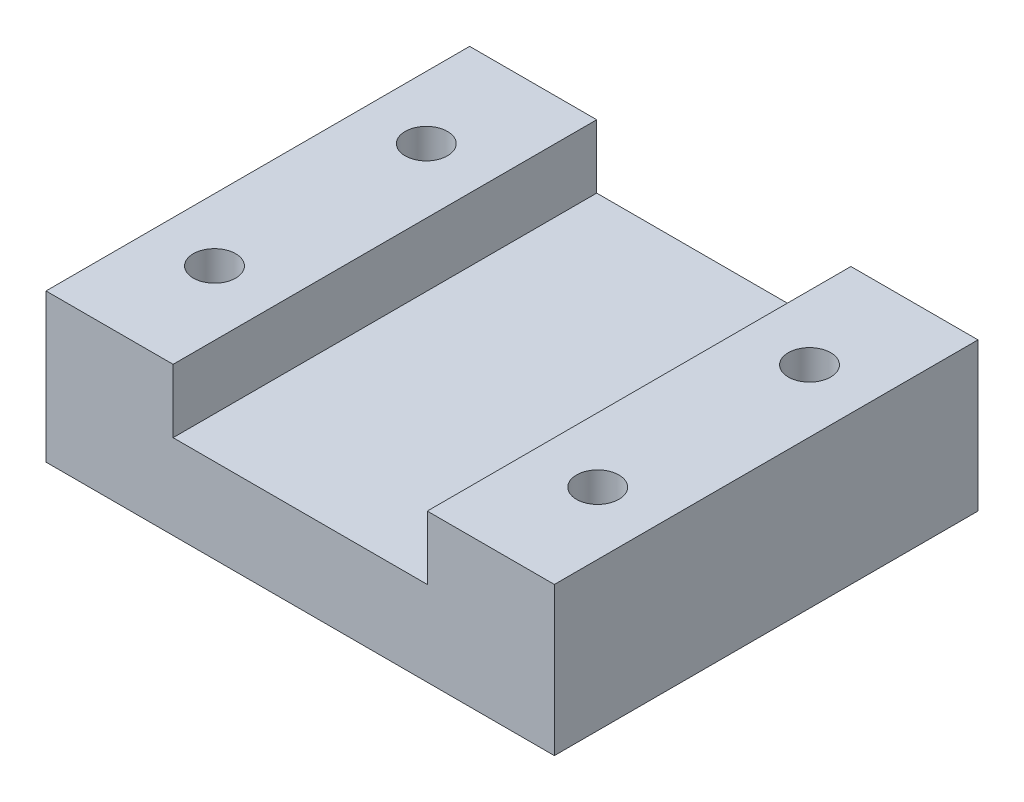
ISO-10303-21;
HEADER;
FILE_DESCRIPTION(('STEP AP214'),'2;1');
FILE_NAME('part.step','',(''),(''),'','','');
FILE_SCHEMA(('AUTOMOTIVE_DESIGN { 1 0 10303 214 1 1 1 1 }'));
ENDSEC;
DATA;
#1=APPLICATION_CONTEXT('core data for automotive mechanical design processes');
#2=APPLICATION_PROTOCOL_DEFINITION('international standard','automotive_design',2000,#1);
#3=PRODUCT_CONTEXT('',#1,'mechanical');
#4=PRODUCT('Part','Part','',(#3));
#5=PRODUCT_RELATED_PRODUCT_CATEGORY('part','',(#4));
#6=PRODUCT_DEFINITION_FORMATION('','',#4);
#7=PRODUCT_DEFINITION_CONTEXT('part definition',#1,'design');
#8=PRODUCT_DEFINITION('design','',#6,#7);
#9=PRODUCT_DEFINITION_SHAPE('','',#8);
#10=(LENGTH_UNIT() NAMED_UNIT(*) SI_UNIT(.MILLI.,.METRE.));
#11=(NAMED_UNIT(*) PLANE_ANGLE_UNIT() SI_UNIT($,.RADIAN.));
#12=(NAMED_UNIT(*) SI_UNIT($,.STERADIAN.) SOLID_ANGLE_UNIT());
#13=UNCERTAINTY_MEASURE_WITH_UNIT(LENGTH_MEASURE(1.E-05),#10,'distance_accuracy_value','');
#14=(GEOMETRIC_REPRESENTATION_CONTEXT(3) GLOBAL_UNCERTAINTY_ASSIGNED_CONTEXT((#13)) GLOBAL_UNIT_ASSIGNED_CONTEXT((#10,
#11,#12)) REPRESENTATION_CONTEXT('',''));
#15=CARTESIAN_POINT('',(0.,0.,0.));
#16=DIRECTION('',(0.,0.,1.));
#17=DIRECTION('',(1.,0.,0.));
#18=AXIS2_PLACEMENT_3D('',#15,#16,#17);
#19=CARTESIAN_POINT('',(-76.2,0.,63.5));
#20=DIRECTION('',(0.,1.,0.));
#21=DIRECTION('',(-1.,0.,0.));
#22=AXIS2_PLACEMENT_3D('',#19,#20,#21);
#23=PLANE('',#22);
#24=CARTESIAN_POINT('',(57.4394586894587,0.,31.75));
#25=DIRECTION('',(0.,-1.,0.));
#26=DIRECTION('',(1.,0.,0.));
#27=AXIS2_PLACEMENT_3D('',#24,#25,#26);
#28=CIRCLE('',#27,6.35);
#29=CARTESIAN_POINT('',(51.0894586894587,0.,31.75));
#30=VERTEX_POINT('',#29);
#31=EDGE_CURVE('E373',#30,#30,#28,.T.);
#32=ORIENTED_EDGE('',*,*,#31,.F.);
#33=EDGE_LOOP('',(#32));
#34=FACE_BOUND('',#33,.T.);
#35=CARTESIAN_POINT('',(-57.4394586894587,0.,-31.75));
#36=DIRECTION('',(0.,1.,0.));
#37=DIRECTION('',(-1.,0.,0.));
#38=AXIS2_PLACEMENT_3D('',#35,#36,#37);
#39=CIRCLE('',#38,6.35);
#40=CARTESIAN_POINT('',(-63.7894586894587,0.,-31.75));
#41=VERTEX_POINT('',#40);
#42=EDGE_CURVE('E379',#41,#41,#39,.T.);
#43=ORIENTED_EDGE('',*,*,#42,.T.);
#44=EDGE_LOOP('',(#43));
#45=FACE_BOUND('',#44,.T.);
#46=CARTESIAN_POINT('',(-57.4394586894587,0.,31.75));
#47=DIRECTION('',(0.,1.,0.));
#48=DIRECTION('',(-1.,0.,0.));
#49=AXIS2_PLACEMENT_3D('',#46,#47,#48);
#50=CIRCLE('',#49,6.35);
#51=CARTESIAN_POINT('',(-63.7894586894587,0.,31.75));
#52=VERTEX_POINT('',#51);
#53=EDGE_CURVE('E125',#52,#52,#50,.T.);
#54=ORIENTED_EDGE('',*,*,#53,.T.);
#55=EDGE_LOOP('',(#54));
#56=FACE_BOUND('',#55,.T.);
#57=DIRECTION('',(1.,0.,0.));
#58=VECTOR('',#57,1.);
#59=CARTESIAN_POINT('',(-76.2,0.,-63.5));
#60=LINE('',#59,#58);
#61=CARTESIAN_POINT('',(-76.2,0.,-63.5));
#62=VERTEX_POINT('',#61);
#63=CARTESIAN_POINT('',(76.2,0.,-63.5));
#64=VERTEX_POINT('',#63);
#65=EDGE_CURVE('E107',#62,#64,#60,.T.);
#66=ORIENTED_EDGE('',*,*,#65,.T.);
#67=DIRECTION('',(0.,0.,-1.));
#68=VECTOR('',#67,1.);
#69=CARTESIAN_POINT('',(76.2,0.,63.5));
#70=LINE('',#69,#68);
#71=CARTESIAN_POINT('',(76.2,0.,63.5));
#72=VERTEX_POINT('',#71);
#73=EDGE_CURVE('E50',#72,#64,#70,.T.);
#74=ORIENTED_EDGE('',*,*,#73,.F.);
#75=DIRECTION('',(1.,0.,0.));
#76=VECTOR('',#75,1.);
#77=CARTESIAN_POINT('',(-76.2,0.,63.5));
#78=LINE('',#77,#76);
#79=CARTESIAN_POINT('',(-76.2,0.,63.5));
#80=VERTEX_POINT('',#79);
#81=EDGE_CURVE('E120',#80,#72,#78,.T.);
#82=ORIENTED_EDGE('',*,*,#81,.F.);
#83=DIRECTION('',(0.,0.,-1.));
#84=VECTOR('',#83,1.);
#85=CARTESIAN_POINT('',(-76.2,0.,63.5));
#86=LINE('',#85,#84);
#87=EDGE_CURVE('E12',#80,#62,#86,.T.);
#88=ORIENTED_EDGE('',*,*,#87,.T.);
#89=EDGE_LOOP('',(#66,#74,#82,#88));
#90=FACE_BOUND('',#89,.T.);
#91=CARTESIAN_POINT('',(57.4394586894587,0.,-31.75));
#92=DIRECTION('',(0.,-1.,0.));
#93=DIRECTION('',(1.,0.,0.));
#94=AXIS2_PLACEMENT_3D('',#91,#92,#93);
#95=CIRCLE('',#94,6.35);
#96=CARTESIAN_POINT('',(51.0894586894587,0.,-31.75));
#97=VERTEX_POINT('',#96);
#98=EDGE_CURVE('E363',#97,#97,#95,.T.);
#99=ORIENTED_EDGE('',*,*,#98,.F.);
#100=EDGE_LOOP('',(#99));
#101=FACE_BOUND('',#100,.T.);
#102=ADVANCED_FACE('F43',(#34,#45,#56,#90,#101),#23,.F.);
#103=CARTESIAN_POINT('',(76.2,44.45,63.5));
#104=DIRECTION('',(0.,-1.,0.));
#105=DIRECTION('',(1.,0.,0.));
#106=AXIS2_PLACEMENT_3D('',#103,#104,#105);
#107=PLANE('',#106);
#108=CARTESIAN_POINT('',(57.4394586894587,44.45,31.75));
#109=DIRECTION('',(0.,-1.,0.));
#110=DIRECTION('',(1.,0.,0.));
#111=AXIS2_PLACEMENT_3D('',#108,#109,#110);
#112=CIRCLE('',#111,6.35);
#113=CARTESIAN_POINT('',(51.0894586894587,44.45,31.75));
#114=VERTEX_POINT('',#113);
#115=EDGE_CURVE('E368',#114,#114,#112,.T.);
#116=ORIENTED_EDGE('',*,*,#115,.T.);
#117=EDGE_LOOP('',(#116));
#118=FACE_BOUND('',#117,.T.);
#119=DIRECTION('',(-1.,0.,0.));
#120=VECTOR('',#119,1.);
#121=CARTESIAN_POINT('',(76.2,44.45,-63.5));
#122=LINE('',#121,#120);
#123=CARTESIAN_POINT('',(76.2,44.45,-63.5));
#124=VERTEX_POINT('',#123);
#125=CARTESIAN_POINT('',(38.1,44.45,-63.5));
#126=VERTEX_POINT('',#125);
#127=EDGE_CURVE('E133',#124,#126,#122,.T.);
#128=ORIENTED_EDGE('',*,*,#127,.T.);
#129=DIRECTION('',(0.,0.,-1.));
#130=VECTOR('',#129,1.);
#131=CARTESIAN_POINT('',(38.1,44.45,63.5));
#132=LINE('',#131,#130);
#133=CARTESIAN_POINT('',(38.1,44.45,63.5));
#134=VERTEX_POINT('',#133);
#135=EDGE_CURVE('E166',#134,#126,#132,.T.);
#136=ORIENTED_EDGE('',*,*,#135,.F.);
#137=DIRECTION('',(-1.,0.,0.));
#138=VECTOR('',#137,1.);
#139=CARTESIAN_POINT('',(76.2,44.45,63.5));
#140=LINE('',#139,#138);
#141=CARTESIAN_POINT('',(76.2,44.45,63.5));
#142=VERTEX_POINT('',#141);
#143=EDGE_CURVE('E148',#142,#134,#140,.T.);
#144=ORIENTED_EDGE('',*,*,#143,.F.);
#145=DIRECTION('',(0.,0.,-1.));
#146=VECTOR('',#145,1.);
#147=CARTESIAN_POINT('',(76.2,44.45,63.5));
#148=LINE('',#147,#146);
#149=EDGE_CURVE('E169',#142,#124,#148,.T.);
#150=ORIENTED_EDGE('',*,*,#149,.T.);
#151=EDGE_LOOP('',(#128,#136,#144,#150));
#152=FACE_BOUND('',#151,.T.);
#153=CARTESIAN_POINT('',(57.4394586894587,44.45,-31.75));
#154=DIRECTION('',(0.,-1.,0.));
#155=DIRECTION('',(1.,0.,0.));
#156=AXIS2_PLACEMENT_3D('',#153,#154,#155);
#157=CIRCLE('',#156,6.35);
#158=CARTESIAN_POINT('',(51.0894586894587,44.45,-31.75));
#159=VERTEX_POINT('',#158);
#160=EDGE_CURVE('E366',#159,#159,#157,.T.);
#161=ORIENTED_EDGE('',*,*,#160,.T.);
#162=EDGE_LOOP('',(#161));
#163=FACE_BOUND('',#162,.T.);
#164=ADVANCED_FACE('F184',(#118,#152,#163),#107,.F.);
#165=CARTESIAN_POINT('',(-76.2,44.45,63.5));
#166=DIRECTION('',(1.,0.,0.));
#167=DIRECTION('',(0.,1.,0.));
#168=AXIS2_PLACEMENT_3D('',#165,#166,#167);
#169=PLANE('',#168);
#170=DIRECTION('',(0.,-1.,0.));
#171=VECTOR('',#170,1.);
#172=CARTESIAN_POINT('',(-76.2,44.45,-63.5));
#173=LINE('',#172,#171);
#174=CARTESIAN_POINT('',(-76.2,44.45,-63.5));
#175=VERTEX_POINT('',#174);
#176=EDGE_CURVE('E111',#175,#62,#173,.T.);
#177=ORIENTED_EDGE('',*,*,#176,.T.);
#178=ORIENTED_EDGE('',*,*,#87,.F.);
#179=DIRECTION('',(0.,-1.,0.));
#180=VECTOR('',#179,1.);
#181=CARTESIAN_POINT('',(-76.2,44.45,63.5));
#182=LINE('',#181,#180);
#183=CARTESIAN_POINT('',(-76.2,44.45,63.5));
#184=VERTEX_POINT('',#183);
#185=EDGE_CURVE('E143',#184,#80,#182,.T.);
#186=ORIENTED_EDGE('',*,*,#185,.F.);
#187=DIRECTION('',(0.,0.,-1.));
#188=VECTOR('',#187,1.);
#189=CARTESIAN_POINT('',(-76.2,44.45,63.5));
#190=LINE('',#189,#188);
#191=EDGE_CURVE('E124',#184,#175,#190,.T.);
#192=ORIENTED_EDGE('',*,*,#191,.T.);
#193=EDGE_LOOP('',(#177,#178,#186,#192));
#194=FACE_BOUND('',#193,.T.);
#195=ADVANCED_FACE('F45',(#194),#169,.F.);
#196=CARTESIAN_POINT('',(76.2,0.,63.5));
#197=DIRECTION('',(-1.,0.,0.));
#198=DIRECTION('',(0.,-1.,0.));
#199=AXIS2_PLACEMENT_3D('',#196,#197,#198);
#200=PLANE('',#199);
#201=DIRECTION('',(0.,1.,0.));
#202=VECTOR('',#201,1.);
#203=CARTESIAN_POINT('',(76.2,0.,-63.5));
#204=LINE('',#203,#202);
#205=EDGE_CURVE('E113',#64,#124,#204,.T.);
#206=ORIENTED_EDGE('',*,*,#205,.T.);
#207=ORIENTED_EDGE('',*,*,#149,.F.);
#208=DIRECTION('',(0.,1.,0.));
#209=VECTOR('',#208,1.);
#210=CARTESIAN_POINT('',(76.2,0.,63.5));
#211=LINE('',#210,#209);
#212=EDGE_CURVE('E146',#72,#142,#211,.T.);
#213=ORIENTED_EDGE('',*,*,#212,.F.);
#214=ORIENTED_EDGE('',*,*,#73,.T.);
#215=EDGE_LOOP('',(#206,#207,#213,#214));
#216=FACE_BOUND('',#215,.T.);
#217=ADVANCED_FACE('F176',(#216),#200,.F.);
#218=CARTESIAN_POINT('',(38.1,44.45,63.5));
#219=DIRECTION('',(1.,0.,0.));
#220=DIRECTION('',(0.,1.,0.));
#221=AXIS2_PLACEMENT_3D('',#218,#219,#220);
#222=PLANE('',#221);
#223=DIRECTION('',(0.,-1.,0.));
#224=VECTOR('',#223,1.);
#225=CARTESIAN_POINT('',(38.1,44.45,-63.5));
#226=LINE('',#225,#224);
#227=CARTESIAN_POINT('',(38.1,25.4,-63.5));
#228=VERTEX_POINT('',#227);
#229=EDGE_CURVE('E135',#126,#228,#226,.T.);
#230=ORIENTED_EDGE('',*,*,#229,.T.);
#231=DIRECTION('',(0.,0.,-1.));
#232=VECTOR('',#231,1.);
#233=CARTESIAN_POINT('',(38.1,25.4,63.5));
#234=LINE('',#233,#232);
#235=CARTESIAN_POINT('',(38.1,25.4,63.5));
#236=VERTEX_POINT('',#235);
#237=EDGE_CURVE('E163',#236,#228,#234,.T.);
#238=ORIENTED_EDGE('',*,*,#237,.F.);
#239=DIRECTION('',(0.,-1.,0.));
#240=VECTOR('',#239,1.);
#241=CARTESIAN_POINT('',(38.1,44.45,63.5));
#242=LINE('',#241,#240);
#243=EDGE_CURVE('E150',#134,#236,#242,.T.);
#244=ORIENTED_EDGE('',*,*,#243,.F.);
#245=ORIENTED_EDGE('',*,*,#135,.T.);
#246=EDGE_LOOP('',(#230,#238,#244,#245));
#247=FACE_BOUND('',#246,.T.);
#248=ADVANCED_FACE('F188',(#247),#222,.F.);
#249=CARTESIAN_POINT('',(38.1,25.4,63.5));
#250=DIRECTION('',(0.,-1.,0.));
#251=DIRECTION('',(1.,0.,0.));
#252=AXIS2_PLACEMENT_3D('',#249,#250,#251);
#253=PLANE('',#252);
#254=DIRECTION('',(-1.,0.,0.));
#255=VECTOR('',#254,1.);
#256=CARTESIAN_POINT('',(38.1,25.4,-63.5));
#257=LINE('',#256,#255);
#258=CARTESIAN_POINT('',(-38.1,25.4,-63.5));
#259=VERTEX_POINT('',#258);
#260=EDGE_CURVE('E137',#228,#259,#257,.T.);
#261=ORIENTED_EDGE('',*,*,#260,.T.);
#262=DIRECTION('',(0.,0.,-1.));
#263=VECTOR('',#262,1.);
#264=CARTESIAN_POINT('',(-38.1,25.4,63.5));
#265=LINE('',#264,#263);
#266=CARTESIAN_POINT('',(-38.1,25.4,63.5));
#267=VERTEX_POINT('',#266);
#268=EDGE_CURVE('E160',#267,#259,#265,.T.);
#269=ORIENTED_EDGE('',*,*,#268,.F.);
#270=DIRECTION('',(-1.,0.,0.));
#271=VECTOR('',#270,1.);
#272=CARTESIAN_POINT('',(38.1,25.4,63.5));
#273=LINE('',#272,#271);
#274=EDGE_CURVE('E152',#236,#267,#273,.T.);
#275=ORIENTED_EDGE('',*,*,#274,.F.);
#276=ORIENTED_EDGE('',*,*,#237,.T.);
#277=EDGE_LOOP('',(#261,#269,#275,#276));
#278=FACE_BOUND('',#277,.T.);
#279=ADVANCED_FACE('F193',(#278),#253,.F.);
#280=CARTESIAN_POINT('',(-38.1,25.4,63.5));
#281=DIRECTION('',(-1.,0.,0.));
#282=DIRECTION('',(0.,-1.,0.));
#283=AXIS2_PLACEMENT_3D('',#280,#281,#282);
#284=PLANE('',#283);
#285=DIRECTION('',(0.,1.,0.));
#286=VECTOR('',#285,1.);
#287=CARTESIAN_POINT('',(-38.1,25.4,-63.5));
#288=LINE('',#287,#286);
#289=CARTESIAN_POINT('',(-38.1,44.45,-63.5));
#290=VERTEX_POINT('',#289);
#291=EDGE_CURVE('E139',#259,#290,#288,.T.);
#292=ORIENTED_EDGE('',*,*,#291,.T.);
#293=DIRECTION('',(0.,0.,-1.));
#294=VECTOR('',#293,1.);
#295=CARTESIAN_POINT('',(-38.1,44.45,63.5));
#296=LINE('',#295,#294);
#297=CARTESIAN_POINT('',(-38.1,44.45,63.5));
#298=VERTEX_POINT('',#297);
#299=EDGE_CURVE('E157',#298,#290,#296,.T.);
#300=ORIENTED_EDGE('',*,*,#299,.F.);
#301=DIRECTION('',(0.,1.,0.));
#302=VECTOR('',#301,1.);
#303=CARTESIAN_POINT('',(-38.1,25.4,63.5));
#304=LINE('',#303,#302);
#305=EDGE_CURVE('E62',#267,#298,#304,.T.);
#306=ORIENTED_EDGE('',*,*,#305,.F.);
#307=ORIENTED_EDGE('',*,*,#268,.T.);
#308=EDGE_LOOP('',(#292,#300,#306,#307));
#309=FACE_BOUND('',#308,.T.);
#310=ADVANCED_FACE('F196',(#309),#284,.F.);
#311=CARTESIAN_POINT('',(-38.1,44.45,63.5));
#312=DIRECTION('',(0.,-1.,0.));
#313=DIRECTION('',(1.,0.,0.));
#314=AXIS2_PLACEMENT_3D('',#311,#312,#313);
#315=PLANE('',#314);
#316=CARTESIAN_POINT('',(-57.4394586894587,44.45,-31.75));
#317=DIRECTION('',(0.,1.,0.));
#318=DIRECTION('',(-1.,0.,0.));
#319=AXIS2_PLACEMENT_3D('',#316,#317,#318);
#320=CIRCLE('',#319,6.35);
#321=CARTESIAN_POINT('',(-63.7894586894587,44.45,-31.75));
#322=VERTEX_POINT('',#321);
#323=EDGE_CURVE('E376',#322,#322,#320,.T.);
#324=ORIENTED_EDGE('',*,*,#323,.F.);
#325=EDGE_LOOP('',(#324));
#326=FACE_BOUND('',#325,.T.);
#327=CARTESIAN_POINT('',(-57.4394586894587,44.45,31.75));
#328=DIRECTION('',(0.,1.,0.));
#329=DIRECTION('',(-1.,0.,0.));
#330=AXIS2_PLACEMENT_3D('',#327,#328,#329);
#331=CIRCLE('',#330,6.35);
#332=CARTESIAN_POINT('',(-63.7894586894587,44.45,31.75));
#333=VERTEX_POINT('',#332);
#334=EDGE_CURVE('E128',#333,#333,#331,.T.);
#335=ORIENTED_EDGE('',*,*,#334,.F.);
#336=EDGE_LOOP('',(#335));
#337=FACE_BOUND('',#336,.T.);
#338=DIRECTION('',(-1.,0.,0.));
#339=VECTOR('',#338,1.);
#340=CARTESIAN_POINT('',(-38.1,44.45,-63.5));
#341=LINE('',#340,#339);
#342=EDGE_CURVE('E141',#290,#175,#341,.T.);
#343=ORIENTED_EDGE('',*,*,#342,.T.);
#344=ORIENTED_EDGE('',*,*,#191,.F.);
#345=DIRECTION('',(-1.,0.,0.));
#346=VECTOR('',#345,1.);
#347=CARTESIAN_POINT('',(-38.1,44.45,63.5));
#348=LINE('',#347,#346);
#349=EDGE_CURVE('E57',#298,#184,#348,.T.);
#350=ORIENTED_EDGE('',*,*,#349,.F.);
#351=ORIENTED_EDGE('',*,*,#299,.T.);
#352=EDGE_LOOP('',(#343,#344,#350,#351));
#353=FACE_BOUND('',#352,.T.);
#354=ADVANCED_FACE('F198',(#326,#337,#353),#315,.F.);
#355=CARTESIAN_POINT('',(-76.2,25.4,63.5));
#356=DIRECTION('',(0.,0.,-1.));
#357=DIRECTION('',(-1.,0.,0.));
#358=AXIS2_PLACEMENT_3D('',#355,#356,#357);
#359=PLANE('',#358);
#360=ORIENTED_EDGE('',*,*,#185,.T.);
#361=ORIENTED_EDGE('',*,*,#81,.T.);
#362=ORIENTED_EDGE('',*,*,#212,.T.);
#363=ORIENTED_EDGE('',*,*,#143,.T.);
#364=ORIENTED_EDGE('',*,*,#243,.T.);
#365=ORIENTED_EDGE('',*,*,#274,.T.);
#366=ORIENTED_EDGE('',*,*,#305,.T.);
#367=ORIENTED_EDGE('',*,*,#349,.T.);
#368=EDGE_LOOP('',(#360,#361,#362,#363,#364,#365,#366,#367));
#369=FACE_BOUND('',#368,.T.);
#370=ADVANCED_FACE('F179',(#369),#359,.F.);
#371=CARTESIAN_POINT('',(-76.2,25.4,-63.5));
#372=DIRECTION('',(0.,0.,-1.));
#373=DIRECTION('',(-1.,0.,0.));
#374=AXIS2_PLACEMENT_3D('',#371,#372,#373);
#375=PLANE('',#374);
#376=ORIENTED_EDGE('',*,*,#176,.F.);
#377=ORIENTED_EDGE('',*,*,#342,.F.);
#378=ORIENTED_EDGE('',*,*,#291,.F.);
#379=ORIENTED_EDGE('',*,*,#260,.F.);
#380=ORIENTED_EDGE('',*,*,#229,.F.);
#381=ORIENTED_EDGE('',*,*,#127,.F.);
#382=ORIENTED_EDGE('',*,*,#205,.F.);
#383=ORIENTED_EDGE('',*,*,#65,.F.);
#384=EDGE_LOOP('',(#376,#377,#378,#379,#380,#381,#382,#383));
#385=FACE_BOUND('',#384,.T.);
#386=ADVANCED_FACE('F108',(#385),#375,.T.);
#387=CARTESIAN_POINT('',(-57.4394586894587,0.,31.75));
#388=DIRECTION('',(0.,1.,0.));
#389=DIRECTION('',(-1.,0.,0.));
#390=AXIS2_PLACEMENT_3D('',#387,#388,#389);
#391=CYLINDRICAL_SURFACE('',#390,6.35);
#392=CARTESIAN_POINT('',(-63.7894586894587,0.,31.75));
#393=CARTESIAN_POINT('',(-63.7894586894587,0.463020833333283,31.75));
#394=CARTESIAN_POINT('',(-63.7894586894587,0.926041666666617,31.75));
#395=CARTESIAN_POINT('',(-63.7894586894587,1.85208333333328,31.75));
#396=CARTESIAN_POINT('',(-63.7894586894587,2.31510416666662,31.75));
#397=CARTESIAN_POINT('',(-63.7894586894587,3.24114583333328,31.75));
#398=CARTESIAN_POINT('',(-63.7894586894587,3.70416666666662,31.75));
#399=CARTESIAN_POINT('',(-63.7894586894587,4.63020833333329,31.75));
#400=CARTESIAN_POINT('',(-63.7894586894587,5.09322916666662,31.75));
#401=CARTESIAN_POINT('',(-63.7894586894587,6.01927083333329,31.75));
#402=CARTESIAN_POINT('',(-63.7894586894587,6.48229166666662,31.75));
#403=CARTESIAN_POINT('',(-63.7894586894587,7.40833333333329,31.75));
#404=CARTESIAN_POINT('',(-63.7894586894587,7.87135416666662,31.75));
#405=CARTESIAN_POINT('',(-63.7894586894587,8.79739583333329,31.75));
#406=CARTESIAN_POINT('',(-63.7894586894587,9.26041666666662,31.75));
#407=CARTESIAN_POINT('',(-63.7894586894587,10.1864583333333,31.75));
#408=CARTESIAN_POINT('',(-63.7894586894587,10.6494791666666,31.75));
#409=CARTESIAN_POINT('',(-63.7894586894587,11.5755208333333,31.75));
#410=CARTESIAN_POINT('',(-63.7894586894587,12.0385416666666,31.75));
#411=CARTESIAN_POINT('',(-63.7894586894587,12.9645833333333,31.75));
#412=CARTESIAN_POINT('',(-63.7894586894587,13.4276041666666,31.75));
#413=CARTESIAN_POINT('',(-63.7894586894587,14.3536458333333,31.75));
#414=CARTESIAN_POINT('',(-63.7894586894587,14.8166666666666,31.75));
#415=CARTESIAN_POINT('',(-63.7894586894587,15.7427083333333,31.75));
#416=CARTESIAN_POINT('',(-63.7894586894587,16.2057291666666,31.75));
#417=CARTESIAN_POINT('',(-63.7894586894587,17.1317708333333,31.75));
#418=CARTESIAN_POINT('',(-63.7894586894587,17.5947916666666,31.75));
#419=CARTESIAN_POINT('',(-63.7894586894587,18.5208333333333,31.75));
#420=CARTESIAN_POINT('',(-63.7894586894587,18.9838541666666,31.75));
#421=CARTESIAN_POINT('',(-63.7894586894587,19.9098958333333,31.75));
#422=CARTESIAN_POINT('',(-63.7894586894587,20.3729166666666,31.75));
#423=CARTESIAN_POINT('',(-63.7894586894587,21.2989583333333,31.75));
#424=CARTESIAN_POINT('',(-63.7894586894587,21.7619791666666,31.75));
#425=CARTESIAN_POINT('',(-63.7894586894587,22.6880208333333,31.75));
#426=CARTESIAN_POINT('',(-63.7894586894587,23.1510416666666,31.75));
#427=CARTESIAN_POINT('',(-63.7894586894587,24.0770833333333,31.75));
#428=CARTESIAN_POINT('',(-63.7894586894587,24.5401041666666,31.75));
#429=CARTESIAN_POINT('',(-63.7894586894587,25.4661458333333,31.75));
#430=CARTESIAN_POINT('',(-63.7894586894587,25.9291666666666,31.75));
#431=CARTESIAN_POINT('',(-63.7894586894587,26.8552083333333,31.75));
#432=CARTESIAN_POINT('',(-63.7894586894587,27.3182291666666,31.75));
#433=CARTESIAN_POINT('',(-63.7894586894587,28.2442708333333,31.75));
#434=CARTESIAN_POINT('',(-63.7894586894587,28.7072916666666,31.75));
#435=CARTESIAN_POINT('',(-63.7894586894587,29.6333333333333,31.75));
#436=CARTESIAN_POINT('',(-63.7894586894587,30.0963541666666,31.75));
#437=CARTESIAN_POINT('',(-63.7894586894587,31.0223958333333,31.75));
#438=CARTESIAN_POINT('',(-63.7894586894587,31.4854166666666,31.75));
#439=CARTESIAN_POINT('',(-63.7894586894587,32.4114583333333,31.75));
#440=CARTESIAN_POINT('',(-63.7894586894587,32.8744791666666,31.75));
#441=CARTESIAN_POINT('',(-63.7894586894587,33.8005208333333,31.75));
#442=CARTESIAN_POINT('',(-63.7894586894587,34.2635416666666,31.75));
#443=CARTESIAN_POINT('',(-63.7894586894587,35.1895833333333,31.75));
#444=CARTESIAN_POINT('',(-63.7894586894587,35.6526041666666,31.75));
#445=CARTESIAN_POINT('',(-63.7894586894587,36.5786458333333,31.75));
#446=CARTESIAN_POINT('',(-63.7894586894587,37.0416666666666,31.75));
#447=CARTESIAN_POINT('',(-63.7894586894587,37.9677083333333,31.75));
#448=CARTESIAN_POINT('',(-63.7894586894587,38.4307291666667,31.75));
#449=CARTESIAN_POINT('',(-63.7894586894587,39.3567708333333,31.75));
#450=CARTESIAN_POINT('',(-63.7894586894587,39.8197916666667,31.75));
#451=CARTESIAN_POINT('',(-63.7894586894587,40.7458333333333,31.75));
#452=CARTESIAN_POINT('',(-63.7894586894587,41.2088541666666,31.75));
#453=CARTESIAN_POINT('',(-63.7894586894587,42.1348958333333,31.75));
#454=CARTESIAN_POINT('',(-63.7894586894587,42.5979166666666,31.75));
#455=CARTESIAN_POINT('',(-63.7894586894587,43.5239583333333,31.75));
#456=CARTESIAN_POINT('',(-63.7894586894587,43.9869791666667,31.75));
#457=CARTESIAN_POINT('',(-63.7894586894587,44.45,31.75));
#458=B_SPLINE_CURVE_WITH_KNOTS('',3,(#392,#393,#394,#395,#396,#397,#398,#399,#400,#401,#402,
#403,#404,#405,#406,#407,#408,#409,#410,#411,#412,#413,#414,#415,#416,#417,#418,#419,#420,#421,
#422,#423,#424,#425,#426,#427,#428,#429,#430,#431,#432,#433,#434,#435,#436,#437,#438,#439,#440,
#441,#442,#443,#444,#445,#446,#447,#448,#449,#450,#451,#452,#453,#454,#455,#456,#457),
.UNSPECIFIED.,.F.,.F.,(4,2,2,2,2,2,2,2,2,2,2,2,2,2,2,2,2,2,2,2,2,2,2,2,2,2,2,2,2,2,2,2,4),(0.,
1.3890625,2.778125,4.1671875,5.55625,6.94531250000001,8.33437500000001,9.72343750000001,11.1125,
12.5015625,13.890625,15.2796875,16.66875,18.0578125,19.446875,20.8359375,22.225,23.6140625,
25.003125,26.3921875,27.78125,29.1703125,30.559375,31.9484375,33.3375,34.7265625,36.115625,
37.5046875,38.89375,40.2828125,41.671875,43.0609375,44.45),.UNSPECIFIED.);
#459=EDGE_CURVE('BSEAM255',#52,#333,#458,.T.);
#460=ORIENTED_EDGE('',*,*,#53,.F.);
#461=ORIENTED_EDGE('',*,*,#334,.T.);
#462=ORIENTED_EDGE('',*,*,#459,.T.);
#463=ORIENTED_EDGE('',*,*,#459,.F.);
#464=EDGE_LOOP('',(#460,#462,#461,#463));
#465=FACE_BOUND('',#464,.T.);
#466=ADVANCED_FACE('F255',(#465),#391,.F.);
#467=CARTESIAN_POINT('',(-57.4394586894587,0.,-31.75));
#468=DIRECTION('',(0.,1.,0.));
#469=DIRECTION('',(-1.,0.,0.));
#470=AXIS2_PLACEMENT_3D('',#467,#468,#469);
#471=CYLINDRICAL_SURFACE('',#470,6.35);
#472=CARTESIAN_POINT('',(-63.7894586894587,0.,-31.75));
#473=CARTESIAN_POINT('',(-63.7894586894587,0.463020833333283,-31.75));
#474=CARTESIAN_POINT('',(-63.7894586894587,0.926041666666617,-31.75));
#475=CARTESIAN_POINT('',(-63.7894586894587,1.85208333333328,-31.75));
#476=CARTESIAN_POINT('',(-63.7894586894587,2.31510416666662,-31.75));
#477=CARTESIAN_POINT('',(-63.7894586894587,3.24114583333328,-31.75));
#478=CARTESIAN_POINT('',(-63.7894586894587,3.70416666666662,-31.75));
#479=CARTESIAN_POINT('',(-63.7894586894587,4.63020833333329,-31.75));
#480=CARTESIAN_POINT('',(-63.7894586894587,5.09322916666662,-31.75));
#481=CARTESIAN_POINT('',(-63.7894586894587,6.01927083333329,-31.75));
#482=CARTESIAN_POINT('',(-63.7894586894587,6.48229166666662,-31.75));
#483=CARTESIAN_POINT('',(-63.7894586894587,7.40833333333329,-31.75));
#484=CARTESIAN_POINT('',(-63.7894586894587,7.87135416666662,-31.75));
#485=CARTESIAN_POINT('',(-63.7894586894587,8.79739583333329,-31.75));
#486=CARTESIAN_POINT('',(-63.7894586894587,9.26041666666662,-31.75));
#487=CARTESIAN_POINT('',(-63.7894586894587,10.1864583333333,-31.75));
#488=CARTESIAN_POINT('',(-63.7894586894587,10.6494791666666,-31.75));
#489=CARTESIAN_POINT('',(-63.7894586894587,11.5755208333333,-31.75));
#490=CARTESIAN_POINT('',(-63.7894586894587,12.0385416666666,-31.75));
#491=CARTESIAN_POINT('',(-63.7894586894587,12.9645833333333,-31.75));
#492=CARTESIAN_POINT('',(-63.7894586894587,13.4276041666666,-31.75));
#493=CARTESIAN_POINT('',(-63.7894586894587,14.3536458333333,-31.75));
#494=CARTESIAN_POINT('',(-63.7894586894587,14.8166666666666,-31.75));
#495=CARTESIAN_POINT('',(-63.7894586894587,15.7427083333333,-31.75));
#496=CARTESIAN_POINT('',(-63.7894586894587,16.2057291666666,-31.75));
#497=CARTESIAN_POINT('',(-63.7894586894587,17.1317708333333,-31.75));
#498=CARTESIAN_POINT('',(-63.7894586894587,17.5947916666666,-31.75));
#499=CARTESIAN_POINT('',(-63.7894586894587,18.5208333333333,-31.75));
#500=CARTESIAN_POINT('',(-63.7894586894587,18.9838541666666,-31.75));
#501=CARTESIAN_POINT('',(-63.7894586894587,19.9098958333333,-31.75));
#502=CARTESIAN_POINT('',(-63.7894586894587,20.3729166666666,-31.75));
#503=CARTESIAN_POINT('',(-63.7894586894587,21.2989583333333,-31.75));
#504=CARTESIAN_POINT('',(-63.7894586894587,21.7619791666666,-31.75));
#505=CARTESIAN_POINT('',(-63.7894586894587,22.6880208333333,-31.75));
#506=CARTESIAN_POINT('',(-63.7894586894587,23.1510416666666,-31.75));
#507=CARTESIAN_POINT('',(-63.7894586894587,24.0770833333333,-31.75));
#508=CARTESIAN_POINT('',(-63.7894586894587,24.5401041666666,-31.75));
#509=CARTESIAN_POINT('',(-63.7894586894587,25.4661458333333,-31.75));
#510=CARTESIAN_POINT('',(-63.7894586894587,25.9291666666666,-31.75));
#511=CARTESIAN_POINT('',(-63.7894586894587,26.8552083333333,-31.75));
#512=CARTESIAN_POINT('',(-63.7894586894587,27.3182291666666,-31.75));
#513=CARTESIAN_POINT('',(-63.7894586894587,28.2442708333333,-31.75));
#514=CARTESIAN_POINT('',(-63.7894586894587,28.7072916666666,-31.75));
#515=CARTESIAN_POINT('',(-63.7894586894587,29.6333333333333,-31.75));
#516=CARTESIAN_POINT('',(-63.7894586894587,30.0963541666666,-31.75));
#517=CARTESIAN_POINT('',(-63.7894586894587,31.0223958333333,-31.75));
#518=CARTESIAN_POINT('',(-63.7894586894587,31.4854166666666,-31.75));
#519=CARTESIAN_POINT('',(-63.7894586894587,32.4114583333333,-31.75));
#520=CARTESIAN_POINT('',(-63.7894586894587,32.8744791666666,-31.75));
#521=CARTESIAN_POINT('',(-63.7894586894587,33.8005208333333,-31.75));
#522=CARTESIAN_POINT('',(-63.7894586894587,34.2635416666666,-31.75));
#523=CARTESIAN_POINT('',(-63.7894586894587,35.1895833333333,-31.75));
#524=CARTESIAN_POINT('',(-63.7894586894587,35.6526041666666,-31.75));
#525=CARTESIAN_POINT('',(-63.7894586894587,36.5786458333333,-31.75));
#526=CARTESIAN_POINT('',(-63.7894586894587,37.0416666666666,-31.75));
#527=CARTESIAN_POINT('',(-63.7894586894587,37.9677083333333,-31.75));
#528=CARTESIAN_POINT('',(-63.7894586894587,38.4307291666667,-31.75));
#529=CARTESIAN_POINT('',(-63.7894586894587,39.3567708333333,-31.75));
#530=CARTESIAN_POINT('',(-63.7894586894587,39.8197916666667,-31.75));
#531=CARTESIAN_POINT('',(-63.7894586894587,40.7458333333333,-31.75));
#532=CARTESIAN_POINT('',(-63.7894586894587,41.2088541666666,-31.75));
#533=CARTESIAN_POINT('',(-63.7894586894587,42.1348958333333,-31.75));
#534=CARTESIAN_POINT('',(-63.7894586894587,42.5979166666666,-31.75));
#535=CARTESIAN_POINT('',(-63.7894586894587,43.5239583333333,-31.75));
#536=CARTESIAN_POINT('',(-63.7894586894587,43.9869791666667,-31.75));
#537=CARTESIAN_POINT('',(-63.7894586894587,44.45,-31.75));
#538=B_SPLINE_CURVE_WITH_KNOTS('',3,(#472,#473,#474,#475,#476,#477,#478,#479,#480,#481,#482,
#483,#484,#485,#486,#487,#488,#489,#490,#491,#492,#493,#494,#495,#496,#497,#498,#499,#500,#501,
#502,#503,#504,#505,#506,#507,#508,#509,#510,#511,#512,#513,#514,#515,#516,#517,#518,#519,#520,
#521,#522,#523,#524,#525,#526,#527,#528,#529,#530,#531,#532,#533,#534,#535,#536,#537),
.UNSPECIFIED.,.F.,.F.,(4,2,2,2,2,2,2,2,2,2,2,2,2,2,2,2,2,2,2,2,2,2,2,2,2,2,2,2,2,2,2,2,4),(0.,
1.3890625,2.778125,4.1671875,5.55625,6.94531250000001,8.33437500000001,9.72343750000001,11.1125,
12.5015625,13.890625,15.2796875,16.66875,18.0578125,19.446875,20.8359375,22.225,23.6140625,
25.003125,26.3921875,27.78125,29.1703125,30.559375,31.9484375,33.3375,34.7265625,36.115625,
37.5046875,38.89375,40.2828125,41.671875,43.0609375,44.45),.UNSPECIFIED.);
#539=EDGE_CURVE('BSEAM264',#41,#322,#538,.T.);
#540=ORIENTED_EDGE('',*,*,#42,.F.);
#541=ORIENTED_EDGE('',*,*,#323,.T.);
#542=ORIENTED_EDGE('',*,*,#539,.T.);
#543=ORIENTED_EDGE('',*,*,#539,.F.);
#544=EDGE_LOOP('',(#540,#542,#541,#543));
#545=FACE_BOUND('',#544,.T.);
#546=ADVANCED_FACE('F264',(#545),#471,.F.);
#547=CARTESIAN_POINT('',(57.4394586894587,0.,31.75));
#548=DIRECTION('',(0.,1.,0.));
#549=DIRECTION('',(-1.,0.,0.));
#550=AXIS2_PLACEMENT_3D('',#547,#548,#549);
#551=CYLINDRICAL_SURFACE('',#550,6.35);
#552=CARTESIAN_POINT('',(51.0894586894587,0.,31.75));
#553=CARTESIAN_POINT('',(51.0894586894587,0.463020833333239,31.75));
#554=CARTESIAN_POINT('',(51.0894586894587,0.926041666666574,31.75));
#555=CARTESIAN_POINT('',(51.0894586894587,1.85208333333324,31.75));
#556=CARTESIAN_POINT('',(51.0894586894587,2.31510416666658,31.75));
#557=CARTESIAN_POINT('',(51.0894586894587,3.24114583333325,31.75));
#558=CARTESIAN_POINT('',(51.0894586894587,3.70416666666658,31.75));
#559=CARTESIAN_POINT('',(51.0894586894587,4.63020833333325,31.75));
#560=CARTESIAN_POINT('',(51.0894586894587,5.09322916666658,31.75));
#561=CARTESIAN_POINT('',(51.0894586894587,6.01927083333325,31.75));
#562=CARTESIAN_POINT('',(51.0894586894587,6.48229166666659,31.75));
#563=CARTESIAN_POINT('',(51.0894586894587,7.40833333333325,31.75));
#564=CARTESIAN_POINT('',(51.0894586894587,7.87135416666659,31.75));
#565=CARTESIAN_POINT('',(51.0894586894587,8.79739583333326,31.75));
#566=CARTESIAN_POINT('',(51.0894586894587,9.26041666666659,31.75));
#567=CARTESIAN_POINT('',(51.0894586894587,10.1864583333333,31.75));
#568=CARTESIAN_POINT('',(51.0894586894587,10.6494791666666,31.75));
#569=CARTESIAN_POINT('',(51.0894586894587,11.5755208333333,31.75));
#570=CARTESIAN_POINT('',(51.0894586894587,12.0385416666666,31.75));
#571=CARTESIAN_POINT('',(51.0894586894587,12.9645833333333,31.75));
#572=CARTESIAN_POINT('',(51.0894586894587,13.4276041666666,31.75));
#573=CARTESIAN_POINT('',(51.0894586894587,14.3536458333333,31.75));
#574=CARTESIAN_POINT('',(51.0894586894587,14.8166666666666,31.75));
#575=CARTESIAN_POINT('',(51.0894586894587,15.7427083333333,31.75));
#576=CARTESIAN_POINT('',(51.0894586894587,16.2057291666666,31.75));
#577=CARTESIAN_POINT('',(51.0894586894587,17.1317708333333,31.75));
#578=CARTESIAN_POINT('',(51.0894586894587,17.5947916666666,31.75));
#579=CARTESIAN_POINT('',(51.0894586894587,18.5208333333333,31.75));
#580=CARTESIAN_POINT('',(51.0894586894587,18.9838541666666,31.75));
#581=CARTESIAN_POINT('',(51.0894586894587,19.9098958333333,31.75));
#582=CARTESIAN_POINT('',(51.0894586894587,20.3729166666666,31.75));
#583=CARTESIAN_POINT('',(51.0894586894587,21.2989583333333,31.75));
#584=CARTESIAN_POINT('',(51.0894586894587,21.7619791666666,31.75));
#585=CARTESIAN_POINT('',(51.0894586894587,22.6880208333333,31.75));
#586=CARTESIAN_POINT('',(51.0894586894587,23.1510416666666,31.75));
#587=CARTESIAN_POINT('',(51.0894586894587,24.0770833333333,31.75));
#588=CARTESIAN_POINT('',(51.0894586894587,24.5401041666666,31.75));
#589=CARTESIAN_POINT('',(51.0894586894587,25.4661458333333,31.75));
#590=CARTESIAN_POINT('',(51.0894586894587,25.9291666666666,31.75));
#591=CARTESIAN_POINT('',(51.0894586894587,26.8552083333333,31.75));
#592=CARTESIAN_POINT('',(51.0894586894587,27.3182291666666,31.75));
#593=CARTESIAN_POINT('',(51.0894586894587,28.2442708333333,31.75));
#594=CARTESIAN_POINT('',(51.0894586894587,28.7072916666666,31.75));
#595=CARTESIAN_POINT('',(51.0894586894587,29.6333333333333,31.75));
#596=CARTESIAN_POINT('',(51.0894586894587,30.0963541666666,31.75));
#597=CARTESIAN_POINT('',(51.0894586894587,31.0223958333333,31.75));
#598=CARTESIAN_POINT('',(51.0894586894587,31.4854166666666,31.75));
#599=CARTESIAN_POINT('',(51.0894586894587,32.4114583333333,31.75));
#600=CARTESIAN_POINT('',(51.0894586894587,32.8744791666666,31.75));
#601=CARTESIAN_POINT('',(51.0894586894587,33.8005208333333,31.75));
#602=CARTESIAN_POINT('',(51.0894586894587,34.2635416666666,31.75));
#603=CARTESIAN_POINT('',(51.0894586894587,35.1895833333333,31.75));
#604=CARTESIAN_POINT('',(51.0894586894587,35.6526041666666,31.75));
#605=CARTESIAN_POINT('',(51.0894586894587,36.5786458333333,31.75));
#606=CARTESIAN_POINT('',(51.0894586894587,37.0416666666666,31.75));
#607=CARTESIAN_POINT('',(51.0894586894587,37.9677083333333,31.75));
#608=CARTESIAN_POINT('',(51.0894586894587,38.4307291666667,31.75));
#609=CARTESIAN_POINT('',(51.0894586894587,39.3567708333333,31.75));
#610=CARTESIAN_POINT('',(51.0894586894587,39.8197916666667,31.75));
#611=CARTESIAN_POINT('',(51.0894586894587,40.7458333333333,31.75));
#612=CARTESIAN_POINT('',(51.0894586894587,41.2088541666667,31.75));
#613=CARTESIAN_POINT('',(51.0894586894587,42.1348958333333,31.75));
#614=CARTESIAN_POINT('',(51.0894586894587,42.5979166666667,31.75));
#615=CARTESIAN_POINT('',(51.0894586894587,43.5239583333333,31.75));
#616=CARTESIAN_POINT('',(51.0894586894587,43.9869791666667,31.75));
#617=CARTESIAN_POINT('',(51.0894586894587,44.45,31.75));
#618=B_SPLINE_CURVE_WITH_KNOTS('',3,(#552,#553,#554,#555,#556,#557,#558,#559,#560,#561,#562,
#563,#564,#565,#566,#567,#568,#569,#570,#571,#572,#573,#574,#575,#576,#577,#578,#579,#580,#581,
#582,#583,#584,#585,#586,#587,#588,#589,#590,#591,#592,#593,#594,#595,#596,#597,#598,#599,#600,
#601,#602,#603,#604,#605,#606,#607,#608,#609,#610,#611,#612,#613,#614,#615,#616,#617),
.UNSPECIFIED.,.F.,.F.,(4,2,2,2,2,2,2,2,2,2,2,2,2,2,2,2,2,2,2,2,2,2,2,2,2,2,2,2,2,2,2,2,4),(0.,
1.3890625,2.77812500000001,4.16718750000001,5.55625000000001,6.94531250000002,8.33437500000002,
9.72343750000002,11.1125,12.5015625,13.890625,15.2796875,16.66875,18.0578125,19.446875,
20.8359375,22.225,23.6140625,25.0031250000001,26.3921875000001,27.7812500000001,
29.1703125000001,30.5593750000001,31.9484375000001,33.3375000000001,34.7265625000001,
36.1156250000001,37.5046875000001,38.8937500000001,40.2828125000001,41.6718750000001,
43.0609375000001,44.4500000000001),.UNSPECIFIED.);
#619=EDGE_CURVE('BSEAM275',#30,#114,#618,.T.);
#620=ORIENTED_EDGE('',*,*,#31,.T.);
#621=ORIENTED_EDGE('',*,*,#115,.F.);
#622=ORIENTED_EDGE('',*,*,#619,.T.);
#623=ORIENTED_EDGE('',*,*,#619,.F.);
#624=EDGE_LOOP('',(#620,#622,#621,#623));
#625=FACE_BOUND('',#624,.T.);
#626=ADVANCED_FACE('F275',(#625),#551,.F.);
#627=CARTESIAN_POINT('',(57.4394586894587,0.,-31.75));
#628=DIRECTION('',(0.,1.,0.));
#629=DIRECTION('',(-1.,0.,0.));
#630=AXIS2_PLACEMENT_3D('',#627,#628,#629);
#631=CYLINDRICAL_SURFACE('',#630,6.35);
#632=CARTESIAN_POINT('',(51.0894586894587,0.,-31.75));
#633=CARTESIAN_POINT('',(51.0894586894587,0.463020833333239,-31.75));
#634=CARTESIAN_POINT('',(51.0894586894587,0.926041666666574,-31.75));
#635=CARTESIAN_POINT('',(51.0894586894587,1.85208333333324,-31.75));
#636=CARTESIAN_POINT('',(51.0894586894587,2.31510416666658,-31.75));
#637=CARTESIAN_POINT('',(51.0894586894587,3.24114583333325,-31.75));
#638=CARTESIAN_POINT('',(51.0894586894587,3.70416666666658,-31.75));
#639=CARTESIAN_POINT('',(51.0894586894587,4.63020833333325,-31.75));
#640=CARTESIAN_POINT('',(51.0894586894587,5.09322916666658,-31.75));
#641=CARTESIAN_POINT('',(51.0894586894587,6.01927083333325,-31.75));
#642=CARTESIAN_POINT('',(51.0894586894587,6.48229166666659,-31.75));
#643=CARTESIAN_POINT('',(51.0894586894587,7.40833333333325,-31.75));
#644=CARTESIAN_POINT('',(51.0894586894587,7.87135416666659,-31.75));
#645=CARTESIAN_POINT('',(51.0894586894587,8.79739583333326,-31.75));
#646=CARTESIAN_POINT('',(51.0894586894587,9.26041666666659,-31.75));
#647=CARTESIAN_POINT('',(51.0894586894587,10.1864583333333,-31.75));
#648=CARTESIAN_POINT('',(51.0894586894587,10.6494791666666,-31.75));
#649=CARTESIAN_POINT('',(51.0894586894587,11.5755208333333,-31.75));
#650=CARTESIAN_POINT('',(51.0894586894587,12.0385416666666,-31.75));
#651=CARTESIAN_POINT('',(51.0894586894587,12.9645833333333,-31.75));
#652=CARTESIAN_POINT('',(51.0894586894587,13.4276041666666,-31.75));
#653=CARTESIAN_POINT('',(51.0894586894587,14.3536458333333,-31.75));
#654=CARTESIAN_POINT('',(51.0894586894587,14.8166666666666,-31.75));
#655=CARTESIAN_POINT('',(51.0894586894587,15.7427083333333,-31.75));
#656=CARTESIAN_POINT('',(51.0894586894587,16.2057291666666,-31.75));
#657=CARTESIAN_POINT('',(51.0894586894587,17.1317708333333,-31.75));
#658=CARTESIAN_POINT('',(51.0894586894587,17.5947916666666,-31.75));
#659=CARTESIAN_POINT('',(51.0894586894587,18.5208333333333,-31.75));
#660=CARTESIAN_POINT('',(51.0894586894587,18.9838541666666,-31.75));
#661=CARTESIAN_POINT('',(51.0894586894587,19.9098958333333,-31.75));
#662=CARTESIAN_POINT('',(51.0894586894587,20.3729166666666,-31.75));
#663=CARTESIAN_POINT('',(51.0894586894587,21.2989583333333,-31.75));
#664=CARTESIAN_POINT('',(51.0894586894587,21.7619791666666,-31.75));
#665=CARTESIAN_POINT('',(51.0894586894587,22.6880208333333,-31.75));
#666=CARTESIAN_POINT('',(51.0894586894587,23.1510416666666,-31.75));
#667=CARTESIAN_POINT('',(51.0894586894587,24.0770833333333,-31.75));
#668=CARTESIAN_POINT('',(51.0894586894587,24.5401041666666,-31.75));
#669=CARTESIAN_POINT('',(51.0894586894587,25.4661458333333,-31.75));
#670=CARTESIAN_POINT('',(51.0894586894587,25.9291666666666,-31.75));
#671=CARTESIAN_POINT('',(51.0894586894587,26.8552083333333,-31.75));
#672=CARTESIAN_POINT('',(51.0894586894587,27.3182291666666,-31.75));
#673=CARTESIAN_POINT('',(51.0894586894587,28.2442708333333,-31.75));
#674=CARTESIAN_POINT('',(51.0894586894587,28.7072916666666,-31.75));
#675=CARTESIAN_POINT('',(51.0894586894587,29.6333333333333,-31.75));
#676=CARTESIAN_POINT('',(51.0894586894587,30.0963541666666,-31.75));
#677=CARTESIAN_POINT('',(51.0894586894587,31.0223958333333,-31.75));
#678=CARTESIAN_POINT('',(51.0894586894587,31.4854166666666,-31.75));
#679=CARTESIAN_POINT('',(51.0894586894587,32.4114583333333,-31.75));
#680=CARTESIAN_POINT('',(51.0894586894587,32.8744791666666,-31.75));
#681=CARTESIAN_POINT('',(51.0894586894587,33.8005208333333,-31.75));
#682=CARTESIAN_POINT('',(51.0894586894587,34.2635416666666,-31.75));
#683=CARTESIAN_POINT('',(51.0894586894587,35.1895833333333,-31.75));
#684=CARTESIAN_POINT('',(51.0894586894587,35.6526041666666,-31.75));
#685=CARTESIAN_POINT('',(51.0894586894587,36.5786458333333,-31.75));
#686=CARTESIAN_POINT('',(51.0894586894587,37.0416666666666,-31.75));
#687=CARTESIAN_POINT('',(51.0894586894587,37.9677083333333,-31.75));
#688=CARTESIAN_POINT('',(51.0894586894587,38.4307291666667,-31.75));
#689=CARTESIAN_POINT('',(51.0894586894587,39.3567708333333,-31.75));
#690=CARTESIAN_POINT('',(51.0894586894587,39.8197916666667,-31.75));
#691=CARTESIAN_POINT('',(51.0894586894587,40.7458333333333,-31.75));
#692=CARTESIAN_POINT('',(51.0894586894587,41.2088541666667,-31.75));
#693=CARTESIAN_POINT('',(51.0894586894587,42.1348958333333,-31.75));
#694=CARTESIAN_POINT('',(51.0894586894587,42.5979166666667,-31.75));
#695=CARTESIAN_POINT('',(51.0894586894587,43.5239583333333,-31.75));
#696=CARTESIAN_POINT('',(51.0894586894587,43.9869791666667,-31.75));
#697=CARTESIAN_POINT('',(51.0894586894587,44.45,-31.75));
#698=B_SPLINE_CURVE_WITH_KNOTS('',3,(#632,#633,#634,#635,#636,#637,#638,#639,#640,#641,#642,
#643,#644,#645,#646,#647,#648,#649,#650,#651,#652,#653,#654,#655,#656,#657,#658,#659,#660,#661,
#662,#663,#664,#665,#666,#667,#668,#669,#670,#671,#672,#673,#674,#675,#676,#677,#678,#679,#680,
#681,#682,#683,#684,#685,#686,#687,#688,#689,#690,#691,#692,#693,#694,#695,#696,#697),
.UNSPECIFIED.,.F.,.F.,(4,2,2,2,2,2,2,2,2,2,2,2,2,2,2,2,2,2,2,2,2,2,2,2,2,2,2,2,2,2,2,2,4),(0.,
1.3890625,2.77812500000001,4.16718750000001,5.55625000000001,6.94531250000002,8.33437500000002,
9.72343750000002,11.1125,12.5015625,13.890625,15.2796875,16.66875,18.0578125,19.446875,
20.8359375,22.225,23.6140625,25.0031250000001,26.3921875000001,27.7812500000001,
29.1703125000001,30.5593750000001,31.9484375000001,33.3375000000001,34.7265625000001,
36.1156250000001,37.5046875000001,38.8937500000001,40.2828125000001,41.6718750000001,
43.0609375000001,44.4500000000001),.UNSPECIFIED.);
#699=EDGE_CURVE('BSEAM286',#97,#159,#698,.T.);
#700=ORIENTED_EDGE('',*,*,#98,.T.);
#701=ORIENTED_EDGE('',*,*,#160,.F.);
#702=ORIENTED_EDGE('',*,*,#699,.T.);
#703=ORIENTED_EDGE('',*,*,#699,.F.);
#704=EDGE_LOOP('',(#700,#702,#701,#703));
#705=FACE_BOUND('',#704,.T.);
#706=ADVANCED_FACE('F286',(#705),#631,.F.);
#707=CLOSED_SHELL('',(#102,#164,#195,#217,#248,#279,#310,#354,#370,#386,#466,#546,#626,#706));
#708=MANIFOLD_SOLID_BREP('B2',#707);
#709=ADVANCED_BREP_SHAPE_REPRESENTATION('',(#18,#708),#14);
#710=SHAPE_DEFINITION_REPRESENTATION(#9,#709);
ENDSEC;
END-ISO-10303-21;
